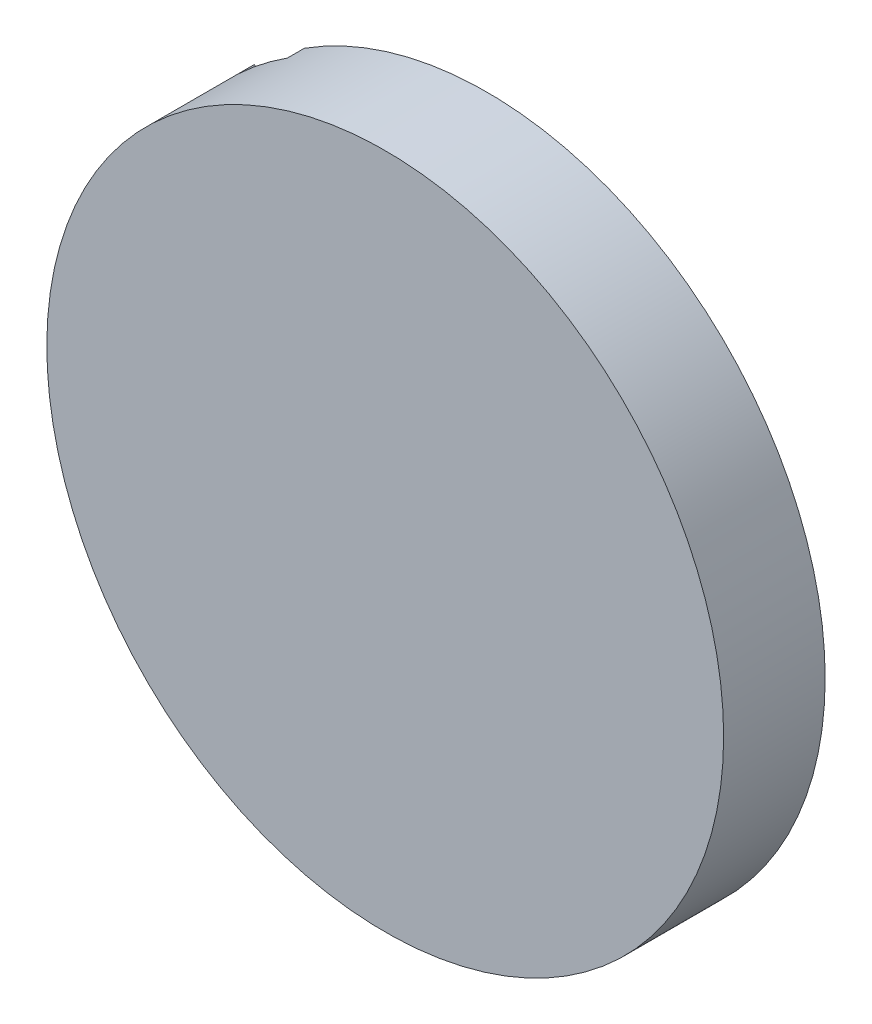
from build123d import *

# Parameters (mm, degrees)
ESQUISSE1_R             = 20
BASE_EXTRUSION_DEPTH    = 6
ENL_V_MAT_EXTRU_1_DEPTH = 1


with BuildPart() as part:
    # Esquisse1 → Base-Extrusion (new body)
    with BuildSketch(Plane.XY):
        with Locations(Location((0, 0, 0), (0, 0, 133.367280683))):
            Circle(ESQUISSE1_R)
    extrude(amount=BASE_EXTRUSION_DEPTH)

    # Esquisse2 → Enl_v. mat.-Extru.1 (cut)
    with BuildSketch(Plane(origin=(0, 0, 0), x_dir=(-1, 0, 0), z_dir=(0, 0, -1))):
        with BuildLine():
            Line((0, 0), (10.78425084, 16.843394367))
            ThreePointArc((10.78425084, 16.843394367), (12.312862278, 15.760501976), (13.733449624, 14.539338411))
            Line((13.733449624, 14.539338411), (0, 0))
        make_face()
    extrude(amount=-ENL_V_MAT_EXTRU_1_DEPTH, mode=Mode.SUBTRACT)


solid = part.part
